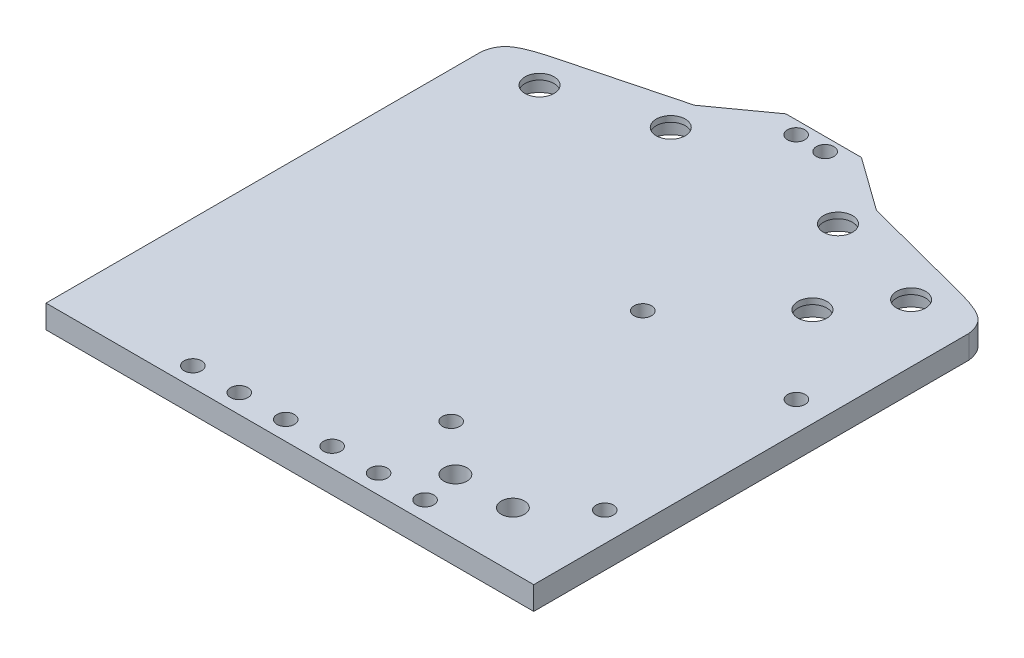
from build123d import *

# Parameters (mm, degrees)
SKETCH1_R           = 2.5
BOSS_EXTRUDE1_DEPTH = 4
SKETCH1_5_R         = 4.1
SKETCH1_5_R_2       = 2.5
CUT_EXTRUDE1_DEPTH  = 3
SKETCH3_R           = 1.500834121
CUT_EXTRUDE6_DEPTH  = 91.443352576
SKETCH7_R           = 1.5
CUT_EXTRUDE5_DEPTH  = 10
SKETCH9_R           = 1.5
CUT_EXTRUDE10_DEPTH = 10
SKETCH6_R           = 2
CUT_EXTRUDE11_DEPTH = 10


with BuildPart() as part:
    # Sketch1 → Boss-Extrude1 (new body)
    with BuildSketch(Plane(origin=(0, 0, 0), x_dir=(1, 0, 0), z_dir=(0, 1, 0))):
        with BuildLine():
            Line((6.501663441, 11.940329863), (0, 11.940329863))
            Line((0, 11.940329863), (-6.501663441, 11.940329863))
            Line((-6.501663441, 11.940329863), (-15.667494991, 5.351958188))
            Line((-15.667494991, 5.351958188), (-32, 1.082267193))
            add(Edge.make_bspline(
                [(-32, 1.082267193), (-34.479638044, 0.458520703), (-39.744583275, -0.833673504), (-41.650365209, -2.841673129), (-42, -5)],
                knots=[0, 0, 0, 0, 0.499397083, 1, 1, 1, 1], degree=3))
            Line((-42, -5), (-42, -80))
            Line((-42, -80), (42, -80))
            Line((42, -80), (42, -5))
            add(Edge.make_bspline(
                [(32, 1.082267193), (34.479638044, 0.458520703), (39.744583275, -0.833673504), (41.650365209, -2.841673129), (42, -5)],
                knots=[0, 0, 0, 0, 0.499397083, 1, 1, 1, 1], degree=3))
            Line((32, 1.082267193), (15.913913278, 5.287538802))
            ThreePointArc((15.913913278, 5.287538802), (15.791077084, 5.321175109), (15.667494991, 5.351958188))
            Line((15.667494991, 5.351958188), (6.501663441, 11.940329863))
        make_face()
        with Locations(Location((25, -15, 0), (0, 0, 270))):
            Circle(SKETCH1_R, mode=Mode.SUBTRACT)
        with Locations(Location((-32, -5, 0), (0, 0, 270))):
            Circle(SKETCH1_R, mode=Mode.SUBTRACT)
        with Locations(Location((-14.4, 0, 0), (0, 0, 270))):
            Circle(SKETCH1_R, mode=Mode.SUBTRACT)
        with Locations(Location((32, -5, 0), (0, 0, 270))):
            Circle(SKETCH1_R, mode=Mode.SUBTRACT)
        with Locations(Location((14.4, 0, 0), (0, 0, 90))):
            Circle(SKETCH1_R, mode=Mode.SUBTRACT)
    extrude(amount=BOSS_EXTRUDE1_DEPTH)

    # Sketch1_5 → Cut-Extrude1 (cut)
    # profile 1 of 5: a face of its own
    with BuildSketch(Plane(origin=(0, 0, 0), x_dir=(1, 0, 0), z_dir=(0, 1, 0))):
        with Locations(Location((25, -15, 0), (0, 0, 270))):
            Circle(SKETCH1_5_R)
        with Locations(Location((25, -15, 0), (0, 0, 270))):
            Circle(SKETCH1_5_R_2, mode=Mode.SUBTRACT)
    # profile 2 of 5: a face of its own
    with BuildSketch(Plane(origin=(0, 0, 0), x_dir=(1, 0, 0), z_dir=(0, 1, 0))):
        with Locations(Location((-32, -5, 0), (0, 0, 270))):
            Circle(SKETCH1_5_R)
        with Locations(Location((-32, -5, 0), (0, 0, 270))):
            Circle(SKETCH1_5_R_2, mode=Mode.SUBTRACT)
    # profile 3 of 5: a face of its own
    with BuildSketch(Plane(origin=(0, 0, 0), x_dir=(1, 0, 0), z_dir=(0, 1, 0))):
        with Locations(Location((32, -5, 0), (0, 0, 270))):
            Circle(SKETCH1_5_R)
        with Locations(Location((32, -5, 0), (0, 0, 270))):
            Circle(SKETCH1_5_R_2, mode=Mode.SUBTRACT)
    # profile 4 of 5: a face of its own
    with BuildSketch(Plane(origin=(0, 0, 0), x_dir=(1, 0, 0), z_dir=(0, 1, 0))):
        with Locations(Location((-14.4, 0, 0), (0, 0, 270))):
            Circle(SKETCH1_5_R)
        with Locations(Location((-14.4, 0, 0), (0, 0, 270))):
            Circle(SKETCH1_5_R_2, mode=Mode.SUBTRACT)
    # profile 5 of 5: a face of its own
    with BuildSketch(Plane(origin=(0, 0, 0), x_dir=(1, 0, 0), z_dir=(0, 1, 0))):
        with Locations(Location((14.4, 0, 0), (0, 0, 90))):
            Circle(SKETCH1_5_R)
        with Locations(Location((14.4, 0, 0), (0, 0, 90))):
            Circle(SKETCH1_5_R_2, mode=Mode.SUBTRACT)
    extrude(amount=CUT_EXTRUDE1_DEPTH, mode=Mode.SUBTRACT)

    # Sketch3 → Cut-Extrude6 (cut, through all)
    with BuildSketch(Plane(origin=(0, 4, 0), x_dir=(1, 0, 0), z_dir=(0, 1, 0))):
        with Locations(Location((-2.5, 9.690329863, 0), (0, 0, 270))):
            Circle(SKETCH3_R)
        with Locations(Location((2.5, 9.690329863, 0), (0, 0, 270))):
            Circle(SKETCH3_R)
    extrude(amount=-CUT_EXTRUDE6_DEPTH, mode=Mode.SUBTRACT)

    # Sketch7 → Cut-Extrude5 (cut)
    with BuildSketch(Plane.XZ):
        with Locations(Location((-4, 76.716650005, 0), (0, 0, 270))):
            Circle(SKETCH7_R)
        with Locations(Location((4, 76.716650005, 0), (0, 0, 270))):
            Circle(SKETCH7_R)
        with Locations(Location((-20, 76.716650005, 0), (0, 0, 270))):
            Circle(SKETCH7_R)
        with Locations(Location((-12, 76.716650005, 0), (0, 0, 270))):
            Circle(SKETCH7_R)
        with Locations(Location((12, 76.716650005, 0), (0, 0, 90))):
            Circle(SKETCH7_R)
        with Locations(Location((20, 76.716650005, 0), (0, 0, 90))):
            Circle(SKETCH7_R)
    extrude(amount=-CUT_EXTRUDE5_DEPTH, mode=Mode.SUBTRACT)

    # Sketch9 → Cut-Extrude10 (cut)
    with BuildSketch(Plane.XZ):
        with Locations(Location((10.54, 62.76, 0), (0, 0, 270))):
            Circle(SKETCH9_R)
        with Locations(Location((37, 62.76, 0), (0, 0, 270))):
            Circle(SKETCH9_R)
        with Locations(Location((37, 29.76, 0), (0, 0, 270))):
            Circle(SKETCH9_R)
        with Locations(Location((10.54, 29.76, 0), (0, 0, 270))):
            Circle(SKETCH9_R)
    extrude(amount=-CUT_EXTRUDE10_DEPTH, mode=Mode.SUBTRACT)

    # Sketch6 → Cut-Extrude11 (cut)
    with BuildSketch(Plane.XZ):
        with Locations(Location((18.82, 70.31, 0), (0, 0, 270))):
            Circle(SKETCH6_R)
        with Locations(Location((28.72, 70.31, 0), (0, 0, 270))):
            Circle(SKETCH6_R)
    extrude(amount=-CUT_EXTRUDE11_DEPTH, mode=Mode.SUBTRACT)


solid = part.part
